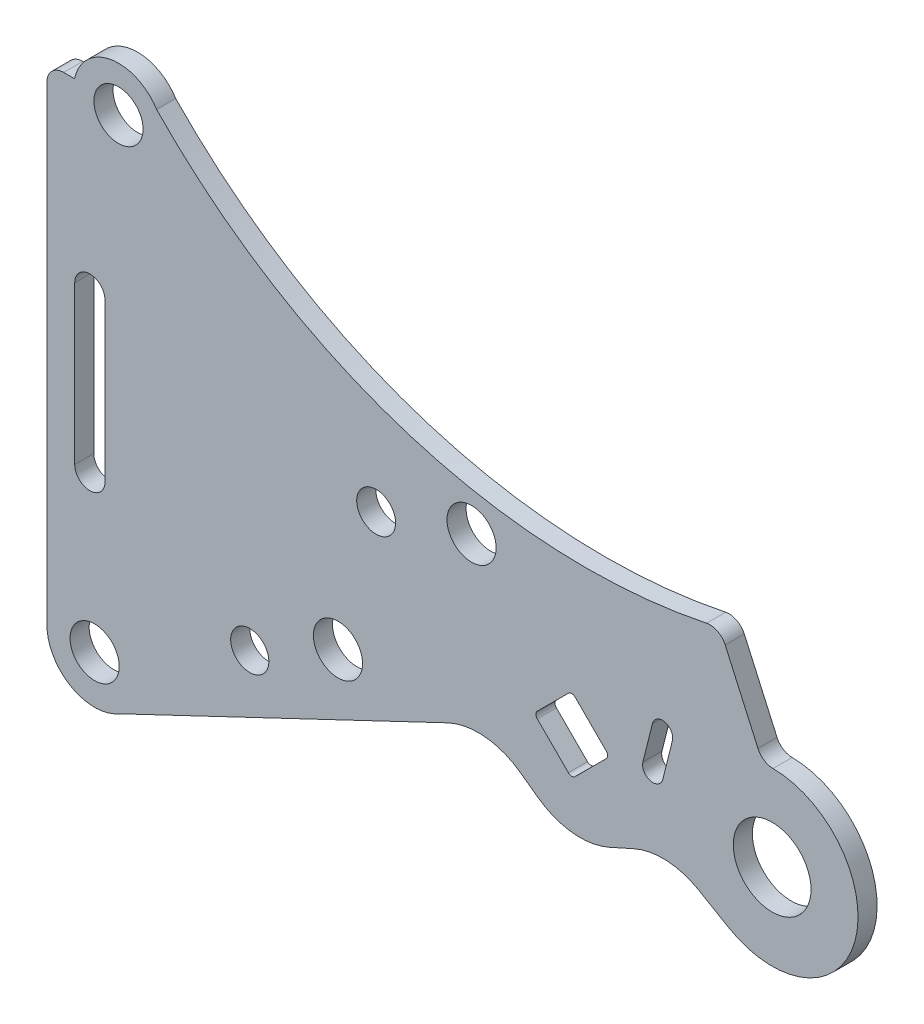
ISO-10303-21;
HEADER;
FILE_DESCRIPTION(('STEP AP214'),'2;1');
FILE_NAME('part.step','',(''),(''),'','','');
FILE_SCHEMA(('AUTOMOTIVE_DESIGN { 1 0 10303 214 1 1 1 1 }'));
ENDSEC;
DATA;
#1=APPLICATION_CONTEXT('core data for automotive mechanical design processes');
#2=APPLICATION_PROTOCOL_DEFINITION('international standard','automotive_design',2000,#1);
#3=PRODUCT_CONTEXT('',#1,'mechanical');
#4=PRODUCT('Part','Part','',(#3));
#5=PRODUCT_RELATED_PRODUCT_CATEGORY('part','',(#4));
#6=PRODUCT_DEFINITION_FORMATION('','',#4);
#7=PRODUCT_DEFINITION_CONTEXT('part definition',#1,'design');
#8=PRODUCT_DEFINITION('design','',#6,#7);
#9=PRODUCT_DEFINITION_SHAPE('','',#8);
#10=(LENGTH_UNIT() NAMED_UNIT(*) SI_UNIT(.MILLI.,.METRE.));
#11=(NAMED_UNIT(*) PLANE_ANGLE_UNIT() SI_UNIT($,.RADIAN.));
#12=(NAMED_UNIT(*) SI_UNIT($,.STERADIAN.) SOLID_ANGLE_UNIT());
#13=UNCERTAINTY_MEASURE_WITH_UNIT(LENGTH_MEASURE(1.E-05),#10,'distance_accuracy_value','');
#14=(GEOMETRIC_REPRESENTATION_CONTEXT(3) GLOBAL_UNCERTAINTY_ASSIGNED_CONTEXT((#13)) GLOBAL_UNIT_ASSIGNED_CONTEXT((#10,
#11,#12)) REPRESENTATION_CONTEXT('',''));
#15=CARTESIAN_POINT('',(0.,0.,0.));
#16=DIRECTION('',(0.,0.,1.));
#17=DIRECTION('',(1.,0.,0.));
#18=AXIS2_PLACEMENT_3D('',#15,#16,#17);
#19=CARTESIAN_POINT('',(-11.5,-1.5,4.));
#20=DIRECTION('',(0.,0.,1.));
#21=DIRECTION('',(1.,0.,0.));
#22=AXIS2_PLACEMENT_3D('',#19,#20,#21);
#23=PLANE('',#22);
#24=CARTESIAN_POINT('',(74.,-39.,4.));
#25=DIRECTION('',(0.,0.,1.));
#26=DIRECTION('',(1.,0.,0.));
#27=AXIS2_PLACEMENT_3D('',#24,#25,#26);
#28=CIRCLE('',#27,5.15);
#29=CARTESIAN_POINT('',(79.15,-39.,4.));
#30=VERTEX_POINT('',#29);
#31=EDGE_CURVE('E391',#30,#30,#28,.T.);
#32=ORIENTED_EDGE('',*,*,#31,.F.);
#33=EDGE_LOOP('',(#32));
#34=FACE_BOUND('',#33,.T.);
#35=CARTESIAN_POINT('',(27.5180743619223,-83.4221581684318,4.));
#36=DIRECTION('',(0.,0.,1.));
#37=DIRECTION('',(1.,0.,0.));
#38=AXIS2_PLACEMENT_3D('',#35,#36,#37);
#39=CIRCLE('',#38,4.);
#40=CARTESIAN_POINT('',(31.5180743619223,-83.4221581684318,4.));
#41=VERTEX_POINT('',#40);
#42=EDGE_CURVE('E403',#41,#41,#39,.T.);
#43=ORIENTED_EDGE('',*,*,#42,.F.);
#44=EDGE_LOOP('',(#43));
#45=FACE_BOUND('',#44,.T.);
#46=CARTESIAN_POINT('',(-4.99999999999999,-100.,4.));
#47=DIRECTION('',(0.,0.,1.));
#48=DIRECTION('',(1.,0.,0.));
#49=AXIS2_PLACEMENT_3D('',#46,#47,#48);
#50=CIRCLE('',#49,5.15);
#51=CARTESIAN_POINT('',(0.150000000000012,-100.,4.));
#52=VERTEX_POINT('',#51);
#53=EDGE_CURVE('E415',#52,#52,#50,.T.);
#54=ORIENTED_EDGE('',*,*,#53,.F.);
#55=EDGE_LOOP('',(#54));
#56=FACE_BOUND('',#55,.T.);
#57=CARTESIAN_POINT('',(-11.5,-1.5,4.));
#58=DIRECTION('',(0.,0.,1.));
#59=DIRECTION('',(1.,0.,0.));
#60=AXIS2_PLACEMENT_3D('',#57,#58,#59);
#61=CIRCLE('',#60,3.5);
#62=CARTESIAN_POINT('',(-11.5,2.,4.));
#63=VERTEX_POINT('',#62);
#64=CARTESIAN_POINT('',(-15.,-1.50000000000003,4.));
#65=VERTEX_POINT('',#64);
#66=EDGE_CURVE('E427',#63,#65,#61,.T.);
#67=ORIENTED_EDGE('',*,*,#66,.T.);
#68=DIRECTION('',(0.,-1.,0.));
#69=VECTOR('',#68,1.);
#70=CARTESIAN_POINT('',(-15.,-1.50000000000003,4.));
#71=LINE('',#70,#69);
#72=CARTESIAN_POINT('',(-15.,-100.,4.));
#73=VERTEX_POINT('',#72);
#74=EDGE_CURVE('E430',#65,#73,#71,.T.);
#75=ORIENTED_EDGE('',*,*,#74,.T.);
#76=CARTESIAN_POINT('',(-4.99999999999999,-100.,4.));
#77=DIRECTION('',(0.,0.,1.));
#78=DIRECTION('',(1.,0.,0.));
#79=AXIS2_PLACEMENT_3D('',#76,#77,#78);
#80=CIRCLE('',#79,9.99999999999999);
#81=CARTESIAN_POINT('',(0.,-108.660254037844,4.));
#82=VERTEX_POINT('',#81);
#83=EDGE_CURVE('E433',#73,#82,#80,.T.);
#84=ORIENTED_EDGE('',*,*,#83,.T.);
#85=DIRECTION('',(0.902889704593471,0.429872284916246,0.));
#86=VECTOR('',#85,1.);
#87=CARTESIAN_POINT('',(0.,-108.660254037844,4.));
#88=LINE('',#87,#86);
#89=CARTESIAN_POINT('',(68.9749888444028,-75.8207655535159,4.));
#90=VERTEX_POINT('',#89);
#91=EDGE_CURVE('E435',#82,#90,#88,.T.);
#92=ORIENTED_EDGE('',*,*,#91,.T.);
#93=CARTESIAN_POINT('',(75.4230731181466,-89.364111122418,4.));
#94=DIRECTION('',(0.,0.,-1.));
#95=DIRECTION('',(-1.,0.,0.));
#96=AXIS2_PLACEMENT_3D('',#93,#94,#95);
#97=CIRCLE('',#96,15.);
#98=CARTESIAN_POINT('',(84.205431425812,-77.2039226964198,4.));
#99=VERTEX_POINT('',#98);
#100=EDGE_CURVE('E437',#90,#99,#97,.T.);
#101=ORIENTED_EDGE('',*,*,#100,.T.);
#102=DIRECTION('',(0.810679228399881,-0.585490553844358,0.));
#103=VECTOR('',#102,1.);
#104=CARTESIAN_POINT('',(84.205431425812,-77.2039226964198,4.));
#105=LINE('',#104,#103);
#106=CARTESIAN_POINT('',(87.9700556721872,-79.9228179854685,4.));
#107=VERTEX_POINT('',#106);
#108=EDGE_CURVE('E439',#99,#107,#105,.T.);
#109=ORIENTED_EDGE('',*,*,#108,.T.);
#110=CARTESIAN_POINT('',(96.7524139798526,-67.7626295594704,4.));
#111=DIRECTION('',(0.,0.,1.));
#112=DIRECTION('',(1.,0.,0.));
#113=AXIS2_PLACEMENT_3D('',#110,#111,#112);
#114=CIRCLE('',#113,15.);
#115=CARTESIAN_POINT('',(102.907884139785,-81.4414521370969,4.));
#116=VERTEX_POINT('',#115);
#117=EDGE_CURVE('E441',#107,#116,#114,.T.);
#118=ORIENTED_EDGE('',*,*,#117,.T.);
#119=DIRECTION('',(0.911921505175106,0.410364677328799,0.));
#120=VECTOR('',#119,1.);
#121=CARTESIAN_POINT('',(102.907884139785,-81.4414521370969,4.));
#122=LINE('',#121,#120);
#123=CARTESIAN_POINT('',(107.95466961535,-79.1703986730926,4.));
#124=VERTEX_POINT('',#123);
#125=EDGE_CURVE('E443',#116,#124,#122,.T.);
#126=ORIENTED_EDGE('',*,*,#125,.T.);
#127=CARTESIAN_POINT('',(114.110139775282,-92.8492212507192,4.));
#128=DIRECTION('',(0.,0.,-1.));
#129=DIRECTION('',(-1.,0.,0.));
#130=AXIS2_PLACEMENT_3D('',#127,#128,#129);
#131=CIRCLE('',#130,15.);
#132=CARTESIAN_POINT('',(121.672191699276,-79.8948640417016,4.));
#133=VERTEX_POINT('',#132);
#134=EDGE_CURVE('E445',#124,#133,#131,.T.);
#135=ORIENTED_EDGE('',*,*,#134,.T.);
#136=DIRECTION('',(0.863623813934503,-0.504136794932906,0.));
#137=VECTOR('',#136,1.);
#138=CARTESIAN_POINT('',(121.672191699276,-79.8948640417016,4.));
#139=LINE('',#138,#137);
#140=CARTESIAN_POINT('',(127.925537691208,-83.545228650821,4.));
#141=VERTEX_POINT('',#140);
#142=EDGE_CURVE('E447',#133,#141,#139,.T.);
#143=ORIENTED_EDGE('',*,*,#142,.T.);
#144=CARTESIAN_POINT('',(137.,-68.,4.));
#145=DIRECTION('',(0.,0.,1.));
#146=DIRECTION('',(1.,0.,0.));
#147=AXIS2_PLACEMENT_3D('',#144,#145,#146);
#148=CIRCLE('',#147,18.);
#149=CARTESIAN_POINT('',(137.183202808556,-50.0009323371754,4.));
#150=VERTEX_POINT('',#149);
#151=EDGE_CURVE('E449',#141,#150,#148,.T.);
#152=ORIENTED_EDGE('',*,*,#151,.T.);
#153=CARTESIAN_POINT('',(137.218825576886,-46.5011136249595,4.));
#154=DIRECTION('',(0.,0.,-1.));
#155=DIRECTION('',(1.,0.,0.));
#156=AXIS2_PLACEMENT_3D('',#153,#154,#155);
#157=CIRCLE('',#156,3.5);
#158=CARTESIAN_POINT('',(134.024125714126,-47.930761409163,4.));
#159=VERTEX_POINT('',#158);
#160=EDGE_CURVE('E451',#150,#159,#157,.T.);
#161=ORIENTED_EDGE('',*,*,#160,.T.);
#162=DIRECTION('',(-0.408470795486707,0.912771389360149,0.));
#163=VECTOR('',#162,1.);
#164=CARTESIAN_POINT('',(134.024125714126,-47.930761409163,4.));
#165=LINE('',#164,#163);
#166=CARTESIAN_POINT('',(127.162179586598,-32.5970137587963,4.));
#167=VERTEX_POINT('',#166);
#168=EDGE_CURVE('E453',#159,#167,#165,.T.);
#169=ORIENTED_EDGE('',*,*,#168,.T.);
#170=CARTESIAN_POINT('',(123.967479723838,-34.0266615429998,4.));
#171=DIRECTION('',(0.,0.,1.));
#172=DIRECTION('',(1.,0.,0.));
#173=AXIS2_PLACEMENT_3D('',#170,#171,#172);
#174=CIRCLE('',#173,3.49999999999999);
#175=CARTESIAN_POINT('',(123.258541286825,-30.5992125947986,4.));
#176=VERTEX_POINT('',#175);
#177=EDGE_CURVE('E455',#167,#176,#174,.T.);
#178=ORIENTED_EDGE('',*,*,#177,.T.);
#179=CARTESIAN_POINT('',(97.9393113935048,91.8096784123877,4.));
#180=DIRECTION('',(0.,0.,-1.));
#181=DIRECTION('',(1.,0.,0.));
#182=AXIS2_PLACEMENT_3D('',#179,#180,#181);
#183=CIRCLE('',#182,125.);
#184=CARTESIAN_POINT('',(8.,5.,4.));
#185=VERTEX_POINT('',#184);
#186=EDGE_CURVE('E457',#176,#185,#183,.T.);
#187=ORIENTED_EDGE('',*,*,#186,.T.);
#188=CARTESIAN_POINT('',(0.,0.,4.));
#189=DIRECTION('',(0.,0.,1.));
#190=DIRECTION('',(1.,0.,0.));
#191=AXIS2_PLACEMENT_3D('',#188,#189,#190);
#192=CIRCLE('',#191,9.4339811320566);
#193=CARTESIAN_POINT('',(-9.21954445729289,2.,4.));
#194=VERTEX_POINT('',#193);
#195=EDGE_CURVE('E459',#185,#194,#192,.T.);
#196=ORIENTED_EDGE('',*,*,#195,.T.);
#197=DIRECTION('',(-1.,0.,0.));
#198=VECTOR('',#197,1.);
#199=CARTESIAN_POINT('',(-9.21954445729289,2.,4.));
#200=LINE('',#199,#198);
#201=EDGE_CURVE('E461',#194,#63,#200,.T.);
#202=ORIENTED_EDGE('',*,*,#201,.T.);
#203=EDGE_LOOP('',(#67,#75,#84,#92,#101,#109,#118,#126,#135,#143,#152,#161,#169,#178,#187,#196,#202));
#204=FACE_BOUND('',#203,.T.);
#205=CARTESIAN_POINT('',(0.,0.,4.));
#206=DIRECTION('',(0.,0.,1.));
#207=DIRECTION('',(1.,0.,0.));
#208=AXIS2_PLACEMENT_3D('',#205,#206,#207);
#209=CIRCLE('',#208,5.15);
#210=CARTESIAN_POINT('',(5.15,0.,4.));
#211=VERTEX_POINT('',#210);
#212=EDGE_CURVE('E421',#211,#211,#209,.T.);
#213=ORIENTED_EDGE('',*,*,#212,.F.);
#214=EDGE_LOOP('',(#213));
#215=FACE_BOUND('',#214,.T.);
#216=CARTESIAN_POINT('',(46.,-74.,4.));
#217=DIRECTION('',(0.,0.,1.));
#218=DIRECTION('',(1.,0.,0.));
#219=AXIS2_PLACEMENT_3D('',#216,#217,#218);
#220=CIRCLE('',#219,5.15);
#221=CARTESIAN_POINT('',(51.15,-74.,4.));
#222=VERTEX_POINT('',#221);
#223=EDGE_CURVE('E409',#222,#222,#220,.T.);
#224=ORIENTED_EDGE('',*,*,#223,.F.);
#225=EDGE_LOOP('',(#224));
#226=FACE_BOUND('',#225,.T.);
#227=CARTESIAN_POINT('',(54.,-45.,4.));
#228=DIRECTION('',(0.,0.,1.));
#229=DIRECTION('',(1.,0.,0.));
#230=AXIS2_PLACEMENT_3D('',#227,#228,#229);
#231=CIRCLE('',#230,4.075);
#232=CARTESIAN_POINT('',(58.075,-45.,4.));
#233=VERTEX_POINT('',#232);
#234=EDGE_CURVE('E397',#233,#233,#231,.T.);
#235=ORIENTED_EDGE('',*,*,#234,.F.);
#236=EDGE_LOOP('',(#235));
#237=FACE_BOUND('',#236,.T.);
#238=CARTESIAN_POINT('',(137.,-68.,4.));
#239=DIRECTION('',(0.,0.,1.));
#240=DIRECTION('',(1.,0.,0.));
#241=AXIS2_PLACEMENT_3D('',#238,#239,#240);
#242=CIRCLE('',#241,8.15);
#243=CARTESIAN_POINT('',(145.15,-68.,4.));
#244=VERTEX_POINT('',#243);
#245=EDGE_CURVE('E385',#244,#244,#242,.T.);
#246=ORIENTED_EDGE('',*,*,#245,.F.);
#247=EDGE_LOOP('',(#246));
#248=FACE_BOUND('',#247,.T.);
#249=DIRECTION('',(0.,1.,0.));
#250=VECTOR('',#249,1.);
#251=CARTESIAN_POINT('',(-2.825,-35.,4.));
#252=LINE('',#251,#250);
#253=CARTESIAN_POINT('',(-2.82499999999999,-68.,4.));
#254=VERTEX_POINT('',#253);
#255=CARTESIAN_POINT('',(-2.825,-35.,4.));
#256=VERTEX_POINT('',#255);
#257=EDGE_CURVE('E356',#254,#256,#252,.T.);
#258=ORIENTED_EDGE('',*,*,#257,.F.);
#259=CARTESIAN_POINT('',(-5.99999999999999,-68.,4.));
#260=DIRECTION('',(0.,0.,1.));
#261=DIRECTION('',(1.,0.,0.));
#262=AXIS2_PLACEMENT_3D('',#259,#260,#261);
#263=CIRCLE('',#262,3.175);
#264=CARTESIAN_POINT('',(-9.17499999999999,-68.,4.));
#265=VERTEX_POINT('',#264);
#266=EDGE_CURVE('E354',#265,#254,#263,.T.);
#267=ORIENTED_EDGE('',*,*,#266,.F.);
#268=DIRECTION('',(0.,-1.,0.));
#269=VECTOR('',#268,1.);
#270=CARTESIAN_POINT('',(-9.17499999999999,-68.,4.));
#271=LINE('',#270,#269);
#272=CARTESIAN_POINT('',(-9.175,-35.,4.));
#273=VERTEX_POINT('',#272);
#274=EDGE_CURVE('E362',#273,#265,#271,.T.);
#275=ORIENTED_EDGE('',*,*,#274,.F.);
#276=CARTESIAN_POINT('',(-6.,-35.,4.));
#277=DIRECTION('',(0.,0.,1.));
#278=DIRECTION('',(1.,0.,0.));
#279=AXIS2_PLACEMENT_3D('',#276,#277,#278);
#280=CIRCLE('',#279,3.175);
#281=EDGE_CURVE('E359',#256,#273,#280,.T.);
#282=ORIENTED_EDGE('',*,*,#281,.F.);
#283=EDGE_LOOP('',(#258,#267,#275,#282));
#284=FACE_BOUND('',#283,.T.);
#285=DIRECTION('',(-0.242535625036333,-0.970142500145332,0.));
#286=VECTOR('',#285,1.);
#287=CARTESIAN_POINT('',(111.914193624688,-54.4785484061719,4.));
#288=LINE('',#287,#286);
#289=CARTESIAN_POINT('',(111.914193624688,-54.4785484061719,4.));
#290=VERTEX_POINT('',#289);
#291=CARTESIAN_POINT('',(109.914193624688,-62.4785484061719,4.));
#292=VERTEX_POINT('',#291);
#293=EDGE_CURVE('E325',#290,#292,#288,.T.);
#294=ORIENTED_EDGE('',*,*,#293,.F.);
#295=CARTESIAN_POINT('',(114.,-55.,4.));
#296=DIRECTION('',(0.,0.,1.));
#297=DIRECTION('',(1.,0.,0.));
#298=AXIS2_PLACEMENT_3D('',#295,#296,#297);
#299=CIRCLE('',#298,2.15);
#300=CARTESIAN_POINT('',(116.085806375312,-55.5214515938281,4.));
#301=VERTEX_POINT('',#300);
#302=EDGE_CURVE('E323',#301,#290,#299,.T.);
#303=ORIENTED_EDGE('',*,*,#302,.F.);
#304=DIRECTION('',(0.24253562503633,0.970142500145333,0.));
#305=VECTOR('',#304,1.);
#306=CARTESIAN_POINT('',(116.085806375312,-55.5214515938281,4.));
#307=LINE('',#306,#305);
#308=CARTESIAN_POINT('',(114.085806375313,-63.5214515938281,4.));
#309=VERTEX_POINT('',#308);
#310=EDGE_CURVE('E331',#309,#301,#307,.T.);
#311=ORIENTED_EDGE('',*,*,#310,.F.);
#312=CARTESIAN_POINT('',(112.,-63.,4.));
#313=DIRECTION('',(0.,0.,1.));
#314=DIRECTION('',(1.,0.,0.));
#315=AXIS2_PLACEMENT_3D('',#312,#313,#314);
#316=CIRCLE('',#315,2.15000000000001);
#317=EDGE_CURVE('E328',#292,#309,#316,.T.);
#318=ORIENTED_EDGE('',*,*,#317,.F.);
#319=EDGE_LOOP('',(#294,#303,#311,#318));
#320=FACE_BOUND('',#319,.T.);
#321=DIRECTION('',(0.70710678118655,-0.707106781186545,0.));
#322=VECTOR('',#321,1.);
#323=CARTESIAN_POINT('',(87.7875108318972,-65.7071067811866,4.));
#324=LINE('',#323,#322);
#325=CARTESIAN_POINT('',(87.7875108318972,-65.7071067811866,4.));
#326=VERTEX_POINT('',#325);
#327=CARTESIAN_POINT('',(94.2928932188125,-72.2124891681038,4.));
#328=VERTEX_POINT('',#327);
#329=EDGE_CURVE('E266',#326,#328,#324,.T.);
#330=ORIENTED_EDGE('',*,*,#329,.F.);
#331=CARTESIAN_POINT('',(88.4946176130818,-64.9999999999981,4.));
#332=DIRECTION('',(0.,0.,1.));
#333=DIRECTION('',(1.,0.,0.));
#334=AXIS2_PLACEMENT_3D('',#331,#332,#333);
#335=CIRCLE('',#334,0.999999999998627);
#336=CARTESIAN_POINT('',(87.7875108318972,-64.2928932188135,4.));
#337=VERTEX_POINT('',#336);
#338=EDGE_CURVE('E258',#337,#326,#335,.T.);
#339=ORIENTED_EDGE('',*,*,#338,.F.);
#340=DIRECTION('',(-0.707106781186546,-0.707106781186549,0.));
#341=VECTOR('',#340,1.);
#342=CARTESIAN_POINT('',(87.7875108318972,-64.2928932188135,4.));
#343=LINE('',#342,#341);
#344=CARTESIAN_POINT('',(94.2928932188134,-57.7875108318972,4.));
#345=VERTEX_POINT('',#344);
#346=EDGE_CURVE('E291',#345,#337,#343,.T.);
#347=ORIENTED_EDGE('',*,*,#346,.F.);
#348=CARTESIAN_POINT('',(94.999999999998,-58.4946176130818,4.));
#349=DIRECTION('',(0.,0.,1.));
#350=DIRECTION('',(-1.,0.,0.));
#351=AXIS2_PLACEMENT_3D('',#348,#349,#350);
#352=CIRCLE('',#351,0.99999999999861);
#353=CARTESIAN_POINT('',(95.7071067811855,-57.7875108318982,4.));
#354=VERTEX_POINT('',#353);
#355=EDGE_CURVE('E289',#354,#345,#352,.T.);
#356=ORIENTED_EDGE('',*,*,#355,.F.);
#357=DIRECTION('',(-0.707106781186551,0.707106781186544,0.));
#358=VECTOR('',#357,1.);
#359=CARTESIAN_POINT('',(95.7071067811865,-57.7875108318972,4.));
#360=LINE('',#359,#358);
#361=CARTESIAN_POINT('',(102.212489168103,-64.2928932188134,4.));
#362=VERTEX_POINT('',#361);
#363=EDGE_CURVE('E287',#362,#354,#360,.T.);
#364=ORIENTED_EDGE('',*,*,#363,.F.);
#365=CARTESIAN_POINT('',(101.505382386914,-64.999999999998,4.));
#366=DIRECTION('',(0.,0.,1.));
#367=DIRECTION('',(1.,0.,0.));
#368=AXIS2_PLACEMENT_3D('',#365,#366,#367);
#369=CIRCLE('',#368,1.00000000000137);
#370=CARTESIAN_POINT('',(102.212489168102,-65.7071067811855,4.));
#371=VERTEX_POINT('',#370);
#372=EDGE_CURVE('E285',#371,#362,#369,.T.);
#373=ORIENTED_EDGE('',*,*,#372,.F.);
#374=DIRECTION('',(0.707106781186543,0.707106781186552,0.));
#375=VECTOR('',#374,1.);
#376=CARTESIAN_POINT('',(95.7071067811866,-72.2124891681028,4.));
#377=LINE('',#376,#375);
#378=CARTESIAN_POINT('',(95.7071067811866,-72.2124891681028,4.));
#379=VERTEX_POINT('',#378);
#380=EDGE_CURVE('E281',#379,#371,#377,.T.);
#381=ORIENTED_EDGE('',*,*,#380,.F.);
#382=CARTESIAN_POINT('',(94.9999999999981,-71.5053823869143,4.));
#383=DIRECTION('',(0.,0.,1.));
#384=DIRECTION('',(1.,0.,0.));
#385=AXIS2_PLACEMENT_3D('',#382,#383,#384);
#386=CIRCLE('',#385,1.00000000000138);
#387=EDGE_CURVE('E279',#328,#379,#386,.T.);
#388=ORIENTED_EDGE('',*,*,#387,.F.);
#389=EDGE_LOOP('',(#330,#339,#347,#356,#364,#373,#381,#388));
#390=FACE_BOUND('',#389,.T.);
#391=ADVANCED_FACE('F43',(#34,#45,#56,#204,#215,#226,#237,#248,#284,#320,#390),#23,.T.);
#392=CARTESIAN_POINT('',(-11.5,-1.5,0.));
#393=DIRECTION('',(0.,0.,1.));
#394=DIRECTION('',(1.,0.,0.));
#395=AXIS2_PLACEMENT_3D('',#392,#393,#394);
#396=PLANE('',#395);
#397=CARTESIAN_POINT('',(114.,-55.,0.));
#398=DIRECTION('',(0.,0.,1.));
#399=DIRECTION('',(1.,0.,0.));
#400=AXIS2_PLACEMENT_3D('',#397,#398,#399);
#401=CIRCLE('',#400,2.15);
#402=CARTESIAN_POINT('',(116.085806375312,-55.5214515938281,0.));
#403=VERTEX_POINT('',#402);
#404=CARTESIAN_POINT('',(111.914193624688,-54.4785484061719,0.));
#405=VERTEX_POINT('',#404);
#406=EDGE_CURVE('E274',#403,#405,#401,.T.);
#407=ORIENTED_EDGE('',*,*,#406,.T.);
#408=DIRECTION('',(-0.242535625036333,-0.970142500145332,0.));
#409=VECTOR('',#408,1.);
#410=CARTESIAN_POINT('',(111.914193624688,-54.4785484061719,0.));
#411=LINE('',#410,#409);
#412=CARTESIAN_POINT('',(109.914193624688,-62.4785484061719,0.));
#413=VERTEX_POINT('',#412);
#414=EDGE_CURVE('E336',#405,#413,#411,.T.);
#415=ORIENTED_EDGE('',*,*,#414,.T.);
#416=CARTESIAN_POINT('',(112.,-63.,0.));
#417=DIRECTION('',(0.,0.,1.));
#418=DIRECTION('',(1.,0.,0.));
#419=AXIS2_PLACEMENT_3D('',#416,#417,#418);
#420=CIRCLE('',#419,2.15000000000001);
#421=CARTESIAN_POINT('',(114.085806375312,-63.5214515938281,0.));
#422=VERTEX_POINT('',#421);
#423=EDGE_CURVE('E339',#413,#422,#420,.T.);
#424=ORIENTED_EDGE('',*,*,#423,.T.);
#425=DIRECTION('',(0.24253562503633,0.970142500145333,0.));
#426=VECTOR('',#425,1.);
#427=CARTESIAN_POINT('',(116.085806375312,-55.5214515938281,0.));
#428=LINE('',#427,#426);
#429=EDGE_CURVE('E326',#422,#403,#428,.T.);
#430=ORIENTED_EDGE('',*,*,#429,.T.);
#431=EDGE_LOOP('',(#407,#415,#424,#430));
#432=FACE_BOUND('',#431,.T.);
#433=CARTESIAN_POINT('',(137.,-68.,0.));
#434=DIRECTION('',(0.,0.,1.));
#435=DIRECTION('',(1.,0.,0.));
#436=AXIS2_PLACEMENT_3D('',#433,#434,#435);
#437=CIRCLE('',#436,8.15);
#438=CARTESIAN_POINT('',(145.15,-68.,0.));
#439=VERTEX_POINT('',#438);
#440=EDGE_CURVE('E384',#439,#439,#437,.T.);
#441=ORIENTED_EDGE('',*,*,#440,.T.);
#442=EDGE_LOOP('',(#441));
#443=FACE_BOUND('',#442,.T.);
#444=CARTESIAN_POINT('',(74.,-39.,0.));
#445=DIRECTION('',(0.,0.,1.));
#446=DIRECTION('',(1.,0.,0.));
#447=AXIS2_PLACEMENT_3D('',#444,#445,#446);
#448=CIRCLE('',#447,5.15);
#449=CARTESIAN_POINT('',(79.15,-39.,0.));
#450=VERTEX_POINT('',#449);
#451=EDGE_CURVE('E388',#450,#450,#448,.T.);
#452=ORIENTED_EDGE('',*,*,#451,.T.);
#453=EDGE_LOOP('',(#452));
#454=FACE_BOUND('',#453,.T.);
#455=CARTESIAN_POINT('',(54.,-45.,0.));
#456=DIRECTION('',(0.,0.,1.));
#457=DIRECTION('',(1.,0.,0.));
#458=AXIS2_PLACEMENT_3D('',#455,#456,#457);
#459=CIRCLE('',#458,4.075);
#460=CARTESIAN_POINT('',(58.075,-45.,0.));
#461=VERTEX_POINT('',#460);
#462=EDGE_CURVE('E394',#461,#461,#459,.T.);
#463=ORIENTED_EDGE('',*,*,#462,.T.);
#464=EDGE_LOOP('',(#463));
#465=FACE_BOUND('',#464,.T.);
#466=CARTESIAN_POINT('',(27.5180743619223,-83.4221581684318,0.));
#467=DIRECTION('',(0.,0.,1.));
#468=DIRECTION('',(1.,0.,0.));
#469=AXIS2_PLACEMENT_3D('',#466,#467,#468);
#470=CIRCLE('',#469,4.);
#471=CARTESIAN_POINT('',(31.5180743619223,-83.4221581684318,0.));
#472=VERTEX_POINT('',#471);
#473=EDGE_CURVE('E400',#472,#472,#470,.T.);
#474=ORIENTED_EDGE('',*,*,#473,.T.);
#475=EDGE_LOOP('',(#474));
#476=FACE_BOUND('',#475,.T.);
#477=CARTESIAN_POINT('',(46.,-74.,0.));
#478=DIRECTION('',(0.,0.,1.));
#479=DIRECTION('',(1.,0.,0.));
#480=AXIS2_PLACEMENT_3D('',#477,#478,#479);
#481=CIRCLE('',#480,5.15);
#482=CARTESIAN_POINT('',(51.15,-74.,0.));
#483=VERTEX_POINT('',#482);
#484=EDGE_CURVE('E406',#483,#483,#481,.T.);
#485=ORIENTED_EDGE('',*,*,#484,.T.);
#486=EDGE_LOOP('',(#485));
#487=FACE_BOUND('',#486,.T.);
#488=CARTESIAN_POINT('',(-4.99999999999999,-100.,0.));
#489=DIRECTION('',(0.,0.,1.));
#490=DIRECTION('',(1.,0.,0.));
#491=AXIS2_PLACEMENT_3D('',#488,#489,#490);
#492=CIRCLE('',#491,5.15);
#493=CARTESIAN_POINT('',(0.150000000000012,-100.,0.));
#494=VERTEX_POINT('',#493);
#495=EDGE_CURVE('E412',#494,#494,#492,.T.);
#496=ORIENTED_EDGE('',*,*,#495,.T.);
#497=EDGE_LOOP('',(#496));
#498=FACE_BOUND('',#497,.T.);
#499=CARTESIAN_POINT('',(0.,0.,0.));
#500=DIRECTION('',(0.,0.,1.));
#501=DIRECTION('',(1.,0.,0.));
#502=AXIS2_PLACEMENT_3D('',#499,#500,#501);
#503=CIRCLE('',#502,5.15);
#504=CARTESIAN_POINT('',(5.15,0.,0.));
#505=VERTEX_POINT('',#504);
#506=EDGE_CURVE('E418',#505,#505,#503,.T.);
#507=ORIENTED_EDGE('',*,*,#506,.T.);
#508=EDGE_LOOP('',(#507));
#509=FACE_BOUND('',#508,.T.);
#510=CARTESIAN_POINT('',(-11.5,-1.5,0.));
#511=DIRECTION('',(0.,0.,1.));
#512=DIRECTION('',(1.,0.,0.));
#513=AXIS2_PLACEMENT_3D('',#510,#511,#512);
#514=CIRCLE('',#513,3.5);
#515=CARTESIAN_POINT('',(-11.5,2.,0.));
#516=VERTEX_POINT('',#515);
#517=CARTESIAN_POINT('',(-15.,-1.50000000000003,0.));
#518=VERTEX_POINT('',#517);
#519=EDGE_CURVE('E424',#516,#518,#514,.T.);
#520=ORIENTED_EDGE('',*,*,#519,.F.);
#521=DIRECTION('',(-1.,0.,0.));
#522=VECTOR('',#521,1.);
#523=CARTESIAN_POINT('',(-9.21954445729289,2.,0.));
#524=LINE('',#523,#522);
#525=CARTESIAN_POINT('',(-9.21954445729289,2.,0.));
#526=VERTEX_POINT('',#525);
#527=EDGE_CURVE('E431',#526,#516,#524,.T.);
#528=ORIENTED_EDGE('',*,*,#527,.F.);
#529=CARTESIAN_POINT('',(0.,0.,0.));
#530=DIRECTION('',(0.,0.,1.));
#531=DIRECTION('',(1.,0.,0.));
#532=AXIS2_PLACEMENT_3D('',#529,#530,#531);
#533=CIRCLE('',#532,9.4339811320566);
#534=CARTESIAN_POINT('',(8.,5.,0.));
#535=VERTEX_POINT('',#534);
#536=EDGE_CURVE('E494',#535,#526,#533,.T.);
#537=ORIENTED_EDGE('',*,*,#536,.F.);
#538=CARTESIAN_POINT('',(97.9393113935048,91.8096784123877,0.));
#539=DIRECTION('',(0.,0.,-1.));
#540=DIRECTION('',(1.,0.,0.));
#541=AXIS2_PLACEMENT_3D('',#538,#539,#540);
#542=CIRCLE('',#541,125.);
#543=CARTESIAN_POINT('',(123.258541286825,-30.5992125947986,0.));
#544=VERTEX_POINT('',#543);
#545=EDGE_CURVE('E492',#544,#535,#542,.T.);
#546=ORIENTED_EDGE('',*,*,#545,.F.);
#547=CARTESIAN_POINT('',(123.967479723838,-34.0266615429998,0.));
#548=DIRECTION('',(0.,0.,1.));
#549=DIRECTION('',(1.,0.,0.));
#550=AXIS2_PLACEMENT_3D('',#547,#548,#549);
#551=CIRCLE('',#550,3.49999999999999);
#552=CARTESIAN_POINT('',(127.162179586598,-32.5970137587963,0.));
#553=VERTEX_POINT('',#552);
#554=EDGE_CURVE('E490',#553,#544,#551,.T.);
#555=ORIENTED_EDGE('',*,*,#554,.F.);
#556=DIRECTION('',(-0.408470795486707,0.912771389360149,0.));
#557=VECTOR('',#556,1.);
#558=CARTESIAN_POINT('',(134.024125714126,-47.930761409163,0.));
#559=LINE('',#558,#557);
#560=CARTESIAN_POINT('',(134.024125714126,-47.930761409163,0.));
#561=VERTEX_POINT('',#560);
#562=EDGE_CURVE('E488',#561,#553,#559,.T.);
#563=ORIENTED_EDGE('',*,*,#562,.F.);
#564=CARTESIAN_POINT('',(137.218825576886,-46.5011136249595,0.));
#565=DIRECTION('',(0.,0.,-1.));
#566=DIRECTION('',(1.,0.,0.));
#567=AXIS2_PLACEMENT_3D('',#564,#565,#566);
#568=CIRCLE('',#567,3.5);
#569=CARTESIAN_POINT('',(137.183202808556,-50.0009323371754,0.));
#570=VERTEX_POINT('',#569);
#571=EDGE_CURVE('E486',#570,#561,#568,.T.);
#572=ORIENTED_EDGE('',*,*,#571,.F.);
#573=CARTESIAN_POINT('',(137.,-68.,0.));
#574=DIRECTION('',(0.,0.,1.));
#575=DIRECTION('',(1.,0.,0.));
#576=AXIS2_PLACEMENT_3D('',#573,#574,#575);
#577=CIRCLE('',#576,18.);
#578=CARTESIAN_POINT('',(127.925537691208,-83.545228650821,0.));
#579=VERTEX_POINT('',#578);
#580=EDGE_CURVE('E484',#579,#570,#577,.T.);
#581=ORIENTED_EDGE('',*,*,#580,.F.);
#582=DIRECTION('',(0.863623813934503,-0.504136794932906,0.));
#583=VECTOR('',#582,1.);
#584=CARTESIAN_POINT('',(121.672191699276,-79.8948640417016,0.));
#585=LINE('',#584,#583);
#586=CARTESIAN_POINT('',(121.672191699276,-79.8948640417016,0.));
#587=VERTEX_POINT('',#586);
#588=EDGE_CURVE('E482',#587,#579,#585,.T.);
#589=ORIENTED_EDGE('',*,*,#588,.F.);
#590=CARTESIAN_POINT('',(114.110139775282,-92.8492212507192,0.));
#591=DIRECTION('',(0.,0.,-1.));
#592=DIRECTION('',(-1.,0.,0.));
#593=AXIS2_PLACEMENT_3D('',#590,#591,#592);
#594=CIRCLE('',#593,15.);
#595=CARTESIAN_POINT('',(107.95466961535,-79.1703986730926,0.));
#596=VERTEX_POINT('',#595);
#597=EDGE_CURVE('E480',#596,#587,#594,.T.);
#598=ORIENTED_EDGE('',*,*,#597,.F.);
#599=DIRECTION('',(0.911921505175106,0.410364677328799,0.));
#600=VECTOR('',#599,1.);
#601=CARTESIAN_POINT('',(102.907884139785,-81.4414521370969,0.));
#602=LINE('',#601,#600);
#603=CARTESIAN_POINT('',(102.907884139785,-81.4414521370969,0.));
#604=VERTEX_POINT('',#603);
#605=EDGE_CURVE('E478',#604,#596,#602,.T.);
#606=ORIENTED_EDGE('',*,*,#605,.F.);
#607=CARTESIAN_POINT('',(96.7524139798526,-67.7626295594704,0.));
#608=DIRECTION('',(0.,0.,1.));
#609=DIRECTION('',(1.,0.,0.));
#610=AXIS2_PLACEMENT_3D('',#607,#608,#609);
#611=CIRCLE('',#610,15.);
#612=CARTESIAN_POINT('',(87.9700556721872,-79.9228179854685,0.));
#613=VERTEX_POINT('',#612);
#614=EDGE_CURVE('E476',#613,#604,#611,.T.);
#615=ORIENTED_EDGE('',*,*,#614,.F.);
#616=DIRECTION('',(0.810679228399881,-0.585490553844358,0.));
#617=VECTOR('',#616,1.);
#618=CARTESIAN_POINT('',(84.205431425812,-77.2039226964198,0.));
#619=LINE('',#618,#617);
#620=CARTESIAN_POINT('',(84.205431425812,-77.2039226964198,0.));
#621=VERTEX_POINT('',#620);
#622=EDGE_CURVE('E474',#621,#613,#619,.T.);
#623=ORIENTED_EDGE('',*,*,#622,.F.);
#624=CARTESIAN_POINT('',(75.4230731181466,-89.364111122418,0.));
#625=DIRECTION('',(0.,0.,-1.));
#626=DIRECTION('',(-1.,0.,0.));
#627=AXIS2_PLACEMENT_3D('',#624,#625,#626);
#628=CIRCLE('',#627,15.);
#629=CARTESIAN_POINT('',(68.9749888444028,-75.8207655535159,0.));
#630=VERTEX_POINT('',#629);
#631=EDGE_CURVE('E472',#630,#621,#628,.T.);
#632=ORIENTED_EDGE('',*,*,#631,.F.);
#633=DIRECTION('',(0.902889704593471,0.429872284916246,0.));
#634=VECTOR('',#633,1.);
#635=CARTESIAN_POINT('',(0.,-108.660254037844,0.));
#636=LINE('',#635,#634);
#637=CARTESIAN_POINT('',(0.,-108.660254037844,0.));
#638=VERTEX_POINT('',#637);
#639=EDGE_CURVE('E470',#638,#630,#636,.T.);
#640=ORIENTED_EDGE('',*,*,#639,.F.);
#641=CARTESIAN_POINT('',(-4.99999999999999,-100.,0.));
#642=DIRECTION('',(0.,0.,1.));
#643=DIRECTION('',(1.,0.,0.));
#644=AXIS2_PLACEMENT_3D('',#641,#642,#643);
#645=CIRCLE('',#644,9.99999999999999);
#646=CARTESIAN_POINT('',(-15.,-100.,0.));
#647=VERTEX_POINT('',#646);
#648=EDGE_CURVE('E468',#647,#638,#645,.T.);
#649=ORIENTED_EDGE('',*,*,#648,.F.);
#650=DIRECTION('',(0.,-1.,0.));
#651=VECTOR('',#650,1.);
#652=CARTESIAN_POINT('',(-15.,-1.50000000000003,0.));
#653=LINE('',#652,#651);
#654=EDGE_CURVE('E466',#518,#647,#653,.T.);
#655=ORIENTED_EDGE('',*,*,#654,.F.);
#656=EDGE_LOOP('',(#520,#528,#537,#546,#555,#563,#572,#581,#589,#598,#606,#615,#623,#632,#640,
#649,#655));
#657=FACE_BOUND('',#656,.T.);
#658=CARTESIAN_POINT('',(-5.99999999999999,-68.,0.));
#659=DIRECTION('',(0.,0.,1.));
#660=DIRECTION('',(1.,0.,0.));
#661=AXIS2_PLACEMENT_3D('',#658,#659,#660);
#662=CIRCLE('',#661,3.175);
#663=CARTESIAN_POINT('',(-9.17499999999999,-68.,0.));
#664=VERTEX_POINT('',#663);
#665=CARTESIAN_POINT('',(-2.82499999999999,-68.,0.));
#666=VERTEX_POINT('',#665);
#667=EDGE_CURVE('E353',#664,#666,#662,.T.);
#668=ORIENTED_EDGE('',*,*,#667,.T.);
#669=DIRECTION('',(0.,1.,0.));
#670=VECTOR('',#669,1.);
#671=CARTESIAN_POINT('',(-2.825,-35.,0.));
#672=LINE('',#671,#670);
#673=CARTESIAN_POINT('',(-2.825,-35.,0.));
#674=VERTEX_POINT('',#673);
#675=EDGE_CURVE('E367',#666,#674,#672,.T.);
#676=ORIENTED_EDGE('',*,*,#675,.T.);
#677=CARTESIAN_POINT('',(-6.,-35.,0.));
#678=DIRECTION('',(0.,0.,1.));
#679=DIRECTION('',(1.,0.,0.));
#680=AXIS2_PLACEMENT_3D('',#677,#678,#679);
#681=CIRCLE('',#680,3.175);
#682=CARTESIAN_POINT('',(-9.175,-35.,0.));
#683=VERTEX_POINT('',#682);
#684=EDGE_CURVE('E370',#674,#683,#681,.T.);
#685=ORIENTED_EDGE('',*,*,#684,.T.);
#686=DIRECTION('',(0.,-1.,0.));
#687=VECTOR('',#686,1.);
#688=CARTESIAN_POINT('',(-9.17499999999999,-68.,0.));
#689=LINE('',#688,#687);
#690=EDGE_CURVE('E357',#683,#664,#689,.T.);
#691=ORIENTED_EDGE('',*,*,#690,.T.);
#692=EDGE_LOOP('',(#668,#676,#685,#691));
#693=FACE_BOUND('',#692,.T.);
#694=CARTESIAN_POINT('',(88.4946176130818,-64.9999999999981,0.));
#695=DIRECTION('',(0.,0.,1.));
#696=DIRECTION('',(1.,0.,0.));
#697=AXIS2_PLACEMENT_3D('',#694,#695,#696);
#698=CIRCLE('',#697,0.999999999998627);
#699=CARTESIAN_POINT('',(87.7875108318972,-64.2928932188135,0.));
#700=VERTEX_POINT('',#699);
#701=CARTESIAN_POINT('',(87.7875108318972,-65.7071067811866,0.));
#702=VERTEX_POINT('',#701);
#703=EDGE_CURVE('E66',#700,#702,#698,.T.);
#704=ORIENTED_EDGE('',*,*,#703,.T.);
#705=DIRECTION('',(0.70710678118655,-0.707106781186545,0.));
#706=VECTOR('',#705,1.);
#707=CARTESIAN_POINT('',(87.7875108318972,-65.7071067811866,0.));
#708=LINE('',#707,#706);
#709=CARTESIAN_POINT('',(94.2928932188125,-72.2124891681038,0.));
#710=VERTEX_POINT('',#709);
#711=EDGE_CURVE('E273',#702,#710,#708,.T.);
#712=ORIENTED_EDGE('',*,*,#711,.T.);
#713=CARTESIAN_POINT('',(94.9999999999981,-71.5053823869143,0.));
#714=DIRECTION('',(0.,0.,1.));
#715=DIRECTION('',(1.,0.,0.));
#716=AXIS2_PLACEMENT_3D('',#713,#714,#715);
#717=CIRCLE('',#716,1.00000000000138);
#718=CARTESIAN_POINT('',(95.7071067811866,-72.2124891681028,0.));
#719=VERTEX_POINT('',#718);
#720=EDGE_CURVE('E295',#710,#719,#717,.T.);
#721=ORIENTED_EDGE('',*,*,#720,.T.);
#722=DIRECTION('',(0.707106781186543,0.707106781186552,0.));
#723=VECTOR('',#722,1.);
#724=CARTESIAN_POINT('',(95.7071067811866,-72.2124891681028,0.));
#725=LINE('',#724,#723);
#726=CARTESIAN_POINT('',(102.212489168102,-65.7071067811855,0.));
#727=VERTEX_POINT('',#726);
#728=EDGE_CURVE('E298',#719,#727,#725,.T.);
#729=ORIENTED_EDGE('',*,*,#728,.T.);
#730=CARTESIAN_POINT('',(101.505382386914,-64.999999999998,0.));
#731=DIRECTION('',(0.,0.,1.));
#732=DIRECTION('',(1.,0.,0.));
#733=AXIS2_PLACEMENT_3D('',#730,#731,#732);
#734=CIRCLE('',#733,1.00000000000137);
#735=CARTESIAN_POINT('',(102.212489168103,-64.2928932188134,0.));
#736=VERTEX_POINT('',#735);
#737=EDGE_CURVE('E301',#727,#736,#734,.T.);
#738=ORIENTED_EDGE('',*,*,#737,.T.);
#739=DIRECTION('',(-0.707106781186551,0.707106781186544,0.));
#740=VECTOR('',#739,1.);
#741=CARTESIAN_POINT('',(95.7071067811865,-57.7875108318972,0.));
#742=LINE('',#741,#740);
#743=CARTESIAN_POINT('',(95.7071067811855,-57.7875108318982,0.));
#744=VERTEX_POINT('',#743);
#745=EDGE_CURVE('E304',#736,#744,#742,.T.);
#746=ORIENTED_EDGE('',*,*,#745,.T.);
#747=CARTESIAN_POINT('',(94.999999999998,-58.4946176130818,0.));
#748=DIRECTION('',(0.,0.,1.));
#749=DIRECTION('',(-1.,0.,0.));
#750=AXIS2_PLACEMENT_3D('',#747,#748,#749);
#751=CIRCLE('',#750,0.99999999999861);
#752=CARTESIAN_POINT('',(94.2928932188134,-57.7875108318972,0.));
#753=VERTEX_POINT('',#752);
#754=EDGE_CURVE('E307',#744,#753,#751,.T.);
#755=ORIENTED_EDGE('',*,*,#754,.T.);
#756=DIRECTION('',(-0.707106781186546,-0.707106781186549,0.));
#757=VECTOR('',#756,1.);
#758=CARTESIAN_POINT('',(87.7875108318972,-64.2928932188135,0.));
#759=LINE('',#758,#757);
#760=EDGE_CURVE('E267',#753,#700,#759,.T.);
#761=ORIENTED_EDGE('',*,*,#760,.T.);
#762=EDGE_LOOP('',(#704,#712,#721,#729,#738,#746,#755,#761));
#763=FACE_BOUND('',#762,.T.);
#764=ADVANCED_FACE('F551',(#432,#443,#454,#465,#476,#487,#498,#509,#657,#693,#763),#396,.F.);
#765=CARTESIAN_POINT('',(-11.5,-1.5,4.));
#766=DIRECTION('',(0.,0.,-1.));
#767=DIRECTION('',(-1.,0.,0.));
#768=AXIS2_PLACEMENT_3D('',#765,#766,#767);
#769=CYLINDRICAL_SURFACE('',#768,3.5);
#770=ORIENTED_EDGE('',*,*,#519,.T.);
#771=DIRECTION('',(0.,0.,-1.));
#772=VECTOR('',#771,1.);
#773=CARTESIAN_POINT('',(-15.,-1.50000000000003,4.));
#774=LINE('',#773,#772);
#775=EDGE_CURVE('E13',#65,#518,#774,.T.);
#776=ORIENTED_EDGE('',*,*,#775,.F.);
#777=ORIENTED_EDGE('',*,*,#66,.F.);
#778=DIRECTION('',(0.,0.,-1.));
#779=VECTOR('',#778,1.);
#780=CARTESIAN_POINT('',(-11.5,2.,4.));
#781=LINE('',#780,#779);
#782=EDGE_CURVE('E463',#63,#516,#781,.T.);
#783=ORIENTED_EDGE('',*,*,#782,.T.);
#784=EDGE_LOOP('',(#770,#776,#777,#783));
#785=FACE_BOUND('',#784,.T.);
#786=ADVANCED_FACE('F45',(#785),#769,.T.);
#787=CARTESIAN_POINT('',(-15.,-1.50000000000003,4.));
#788=DIRECTION('',(1.,0.,0.));
#789=DIRECTION('',(0.,0.,-1.));
#790=AXIS2_PLACEMENT_3D('',#787,#788,#789);
#791=PLANE('',#790);
#792=ORIENTED_EDGE('',*,*,#654,.T.);
#793=DIRECTION('',(0.,0.,-1.));
#794=VECTOR('',#793,1.);
#795=CARTESIAN_POINT('',(-15.,-100.,4.));
#796=LINE('',#795,#794);
#797=EDGE_CURVE('E51',#73,#647,#796,.T.);
#798=ORIENTED_EDGE('',*,*,#797,.F.);
#799=ORIENTED_EDGE('',*,*,#74,.F.);
#800=ORIENTED_EDGE('',*,*,#775,.T.);
#801=EDGE_LOOP('',(#792,#798,#799,#800));
#802=FACE_BOUND('',#801,.T.);
#803=ADVANCED_FACE('F569',(#802),#791,.F.);
#804=CARTESIAN_POINT('',(-4.99999999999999,-100.,4.));
#805=DIRECTION('',(0.,0.,-1.));
#806=DIRECTION('',(-1.,0.,0.));
#807=AXIS2_PLACEMENT_3D('',#804,#805,#806);
#808=CYLINDRICAL_SURFACE('',#807,9.99999999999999);
#809=ORIENTED_EDGE('',*,*,#648,.T.);
#810=DIRECTION('',(0.,0.,-1.));
#811=VECTOR('',#810,1.);
#812=CARTESIAN_POINT('',(0.,-108.660254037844,4.));
#813=LINE('',#812,#811);
#814=EDGE_CURVE('E538',#82,#638,#813,.T.);
#815=ORIENTED_EDGE('',*,*,#814,.F.);
#816=ORIENTED_EDGE('',*,*,#83,.F.);
#817=ORIENTED_EDGE('',*,*,#797,.T.);
#818=EDGE_LOOP('',(#809,#815,#816,#817));
#819=FACE_BOUND('',#818,.T.);
#820=ADVANCED_FACE('F545',(#819),#808,.T.);
#821=CARTESIAN_POINT('',(0.,-108.660254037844,4.));
#822=DIRECTION('',(-0.429872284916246,0.902889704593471,0.));
#823=DIRECTION('',(-0.902889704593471,-0.429872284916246,0.));
#824=AXIS2_PLACEMENT_3D('',#821,#822,#823);
#825=PLANE('',#824);
#826=ORIENTED_EDGE('',*,*,#639,.T.);
#827=DIRECTION('',(0.,0.,-1.));
#828=VECTOR('',#827,1.);
#829=CARTESIAN_POINT('',(68.9749888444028,-75.8207655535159,4.));
#830=LINE('',#829,#828);
#831=EDGE_CURVE('E535',#90,#630,#830,.T.);
#832=ORIENTED_EDGE('',*,*,#831,.F.);
#833=ORIENTED_EDGE('',*,*,#91,.F.);
#834=ORIENTED_EDGE('',*,*,#814,.T.);
#835=EDGE_LOOP('',(#826,#832,#833,#834));
#836=FACE_BOUND('',#835,.T.);
#837=ADVANCED_FACE('F557',(#836),#825,.F.);
#838=CARTESIAN_POINT('',(75.4230731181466,-89.364111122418,4.));
#839=DIRECTION('',(0.,0.,-1.));
#840=DIRECTION('',(-1.,0.,0.));
#841=AXIS2_PLACEMENT_3D('',#838,#839,#840);
#842=CYLINDRICAL_SURFACE('',#841,15.);
#843=ORIENTED_EDGE('',*,*,#631,.T.);
#844=DIRECTION('',(0.,0.,-1.));
#845=VECTOR('',#844,1.);
#846=CARTESIAN_POINT('',(84.205431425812,-77.2039226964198,4.));
#847=LINE('',#846,#845);
#848=EDGE_CURVE('E532',#99,#621,#847,.T.);
#849=ORIENTED_EDGE('',*,*,#848,.F.);
#850=ORIENTED_EDGE('',*,*,#100,.F.);
#851=ORIENTED_EDGE('',*,*,#831,.T.);
#852=EDGE_LOOP('',(#843,#849,#850,#851));
#853=FACE_BOUND('',#852,.T.);
#854=ADVANCED_FACE('F561',(#853),#842,.F.);
#855=CARTESIAN_POINT('',(84.205431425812,-77.2039226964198,4.));
#856=DIRECTION('',(0.585490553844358,0.810679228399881,0.));
#857=DIRECTION('',(-0.810679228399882,0.585490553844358,0.));
#858=AXIS2_PLACEMENT_3D('',#855,#856,#857);
#859=PLANE('',#858);
#860=ORIENTED_EDGE('',*,*,#622,.T.);
#861=DIRECTION('',(0.,0.,-1.));
#862=VECTOR('',#861,1.);
#863=CARTESIAN_POINT('',(87.9700556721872,-79.9228179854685,4.));
#864=LINE('',#863,#862);
#865=EDGE_CURVE('E529',#107,#613,#864,.T.);
#866=ORIENTED_EDGE('',*,*,#865,.F.);
#867=ORIENTED_EDGE('',*,*,#108,.F.);
#868=ORIENTED_EDGE('',*,*,#848,.T.);
#869=EDGE_LOOP('',(#860,#866,#867,#868));
#870=FACE_BOUND('',#869,.T.);
#871=ADVANCED_FACE('F627',(#870),#859,.F.);
#872=CARTESIAN_POINT('',(96.7524139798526,-67.7626295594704,4.));
#873=DIRECTION('',(0.,0.,-1.));
#874=DIRECTION('',(-1.,0.,0.));
#875=AXIS2_PLACEMENT_3D('',#872,#873,#874);
#876=CYLINDRICAL_SURFACE('',#875,15.);
#877=ORIENTED_EDGE('',*,*,#614,.T.);
#878=DIRECTION('',(0.,0.,-1.));
#879=VECTOR('',#878,1.);
#880=CARTESIAN_POINT('',(102.907884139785,-81.4414521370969,4.));
#881=LINE('',#880,#879);
#882=EDGE_CURVE('E526',#116,#604,#881,.T.);
#883=ORIENTED_EDGE('',*,*,#882,.F.);
#884=ORIENTED_EDGE('',*,*,#117,.F.);
#885=ORIENTED_EDGE('',*,*,#865,.T.);
#886=EDGE_LOOP('',(#877,#883,#884,#885));
#887=FACE_BOUND('',#886,.T.);
#888=ADVANCED_FACE('F625',(#887),#876,.T.);
#889=CARTESIAN_POINT('',(102.907884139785,-81.4414521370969,4.));
#890=DIRECTION('',(-0.410364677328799,0.911921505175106,0.));
#891=DIRECTION('',(-0.911921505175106,-0.410364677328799,0.));
#892=AXIS2_PLACEMENT_3D('',#889,#890,#891);
#893=PLANE('',#892);
#894=ORIENTED_EDGE('',*,*,#605,.T.);
#895=DIRECTION('',(0.,0.,-1.));
#896=VECTOR('',#895,1.);
#897=CARTESIAN_POINT('',(107.95466961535,-79.1703986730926,4.));
#898=LINE('',#897,#896);
#899=EDGE_CURVE('E523',#124,#596,#898,.T.);
#900=ORIENTED_EDGE('',*,*,#899,.F.);
#901=ORIENTED_EDGE('',*,*,#125,.F.);
#902=ORIENTED_EDGE('',*,*,#882,.T.);
#903=EDGE_LOOP('',(#894,#900,#901,#902));
#904=FACE_BOUND('',#903,.T.);
#905=ADVANCED_FACE('F620',(#904),#893,.F.);
#906=CARTESIAN_POINT('',(114.110139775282,-92.8492212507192,4.));
#907=DIRECTION('',(0.,0.,-1.));
#908=DIRECTION('',(-1.,0.,0.));
#909=AXIS2_PLACEMENT_3D('',#906,#907,#908);
#910=CYLINDRICAL_SURFACE('',#909,15.);
#911=ORIENTED_EDGE('',*,*,#597,.T.);
#912=DIRECTION('',(0.,0.,-1.));
#913=VECTOR('',#912,1.);
#914=CARTESIAN_POINT('',(121.672191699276,-79.8948640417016,4.));
#915=LINE('',#914,#913);
#916=EDGE_CURVE('E520',#133,#587,#915,.T.);
#917=ORIENTED_EDGE('',*,*,#916,.F.);
#918=ORIENTED_EDGE('',*,*,#134,.F.);
#919=ORIENTED_EDGE('',*,*,#899,.T.);
#920=EDGE_LOOP('',(#911,#917,#918,#919));
#921=FACE_BOUND('',#920,.T.);
#922=ADVANCED_FACE('F615',(#921),#910,.F.);
#923=CARTESIAN_POINT('',(121.672191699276,-79.8948640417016,4.));
#924=DIRECTION('',(0.504136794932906,0.863623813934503,0.));
#925=DIRECTION('',(-0.863623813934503,0.504136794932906,0.));
#926=AXIS2_PLACEMENT_3D('',#923,#924,#925);
#927=PLANE('',#926);
#928=ORIENTED_EDGE('',*,*,#588,.T.);
#929=DIRECTION('',(0.,0.,-1.));
#930=VECTOR('',#929,1.);
#931=CARTESIAN_POINT('',(127.925537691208,-83.545228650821,4.));
#932=LINE('',#931,#930);
#933=EDGE_CURVE('E517',#141,#579,#932,.T.);
#934=ORIENTED_EDGE('',*,*,#933,.F.);
#935=ORIENTED_EDGE('',*,*,#142,.F.);
#936=ORIENTED_EDGE('',*,*,#916,.T.);
#937=EDGE_LOOP('',(#928,#934,#935,#936));
#938=FACE_BOUND('',#937,.T.);
#939=ADVANCED_FACE('F611',(#938),#927,.F.);
#940=CARTESIAN_POINT('',(137.,-68.,4.));
#941=DIRECTION('',(0.,0.,-1.));
#942=DIRECTION('',(-1.,0.,0.));
#943=AXIS2_PLACEMENT_3D('',#940,#941,#942);
#944=CYLINDRICAL_SURFACE('',#943,18.);
#945=ORIENTED_EDGE('',*,*,#580,.T.);
#946=DIRECTION('',(0.,0.,-1.));
#947=VECTOR('',#946,1.);
#948=CARTESIAN_POINT('',(137.183202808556,-50.0009323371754,4.));
#949=LINE('',#948,#947);
#950=EDGE_CURVE('E514',#150,#570,#949,.T.);
#951=ORIENTED_EDGE('',*,*,#950,.F.);
#952=ORIENTED_EDGE('',*,*,#151,.F.);
#953=ORIENTED_EDGE('',*,*,#933,.T.);
#954=EDGE_LOOP('',(#945,#951,#952,#953));
#955=FACE_BOUND('',#954,.T.);
#956=ADVANCED_FACE('F606',(#955),#944,.T.);
#957=CARTESIAN_POINT('',(137.218825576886,-46.5011136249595,4.));
#958=DIRECTION('',(0.,0.,-1.));
#959=DIRECTION('',(-1.,0.,0.));
#960=AXIS2_PLACEMENT_3D('',#957,#958,#959);
#961=CYLINDRICAL_SURFACE('',#960,3.5);
#962=ORIENTED_EDGE('',*,*,#571,.T.);
#963=DIRECTION('',(0.,0.,-1.));
#964=VECTOR('',#963,1.);
#965=CARTESIAN_POINT('',(134.024125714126,-47.930761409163,4.));
#966=LINE('',#965,#964);
#967=EDGE_CURVE('E511',#159,#561,#966,.T.);
#968=ORIENTED_EDGE('',*,*,#967,.F.);
#969=ORIENTED_EDGE('',*,*,#160,.F.);
#970=ORIENTED_EDGE('',*,*,#950,.T.);
#971=EDGE_LOOP('',(#962,#968,#969,#970));
#972=FACE_BOUND('',#971,.T.);
#973=ADVANCED_FACE('F600',(#972),#961,.F.);
#974=CARTESIAN_POINT('',(134.024125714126,-47.930761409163,4.));
#975=DIRECTION('',(-0.912771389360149,-0.408470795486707,0.));
#976=DIRECTION('',(0.408470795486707,-0.912771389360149,0.));
#977=AXIS2_PLACEMENT_3D('',#974,#975,#976);
#978=PLANE('',#977);
#979=ORIENTED_EDGE('',*,*,#562,.T.);
#980=DIRECTION('',(0.,0.,-1.));
#981=VECTOR('',#980,1.);
#982=CARTESIAN_POINT('',(127.162179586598,-32.5970137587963,4.));
#983=LINE('',#982,#981);
#984=EDGE_CURVE('E508',#167,#553,#983,.T.);
#985=ORIENTED_EDGE('',*,*,#984,.F.);
#986=ORIENTED_EDGE('',*,*,#168,.F.);
#987=ORIENTED_EDGE('',*,*,#967,.T.);
#988=EDGE_LOOP('',(#979,#985,#986,#987));
#989=FACE_BOUND('',#988,.T.);
#990=ADVANCED_FACE('F596',(#989),#978,.F.);
#991=CARTESIAN_POINT('',(123.967479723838,-34.0266615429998,4.));
#992=DIRECTION('',(0.,0.,-1.));
#993=DIRECTION('',(-1.,0.,0.));
#994=AXIS2_PLACEMENT_3D('',#991,#992,#993);
#995=CYLINDRICAL_SURFACE('',#994,3.49999999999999);
#996=ORIENTED_EDGE('',*,*,#554,.T.);
#997=DIRECTION('',(0.,0.,-1.));
#998=VECTOR('',#997,1.);
#999=CARTESIAN_POINT('',(123.258541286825,-30.5992125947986,4.));
#1000=LINE('',#999,#998);
#1001=EDGE_CURVE('E505',#176,#544,#1000,.T.);
#1002=ORIENTED_EDGE('',*,*,#1001,.F.);
#1003=ORIENTED_EDGE('',*,*,#177,.F.);
#1004=ORIENTED_EDGE('',*,*,#984,.T.);
#1005=EDGE_LOOP('',(#996,#1002,#1003,#1004));
#1006=FACE_BOUND('',#1005,.T.);
#1007=ADVANCED_FACE('F591',(#1006),#995,.T.);
#1008=CARTESIAN_POINT('',(97.9393113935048,91.8096784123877,4.));
#1009=DIRECTION('',(0.,0.,-1.));
#1010=DIRECTION('',(-1.,0.,0.));
#1011=AXIS2_PLACEMENT_3D('',#1008,#1009,#1010);
#1012=CYLINDRICAL_SURFACE('',#1011,125.);
#1013=ORIENTED_EDGE('',*,*,#545,.T.);
#1014=DIRECTION('',(0.,0.,-1.));
#1015=VECTOR('',#1014,1.);
#1016=CARTESIAN_POINT('',(8.,5.,4.));
#1017=LINE('',#1016,#1015);
#1018=EDGE_CURVE('E502',#185,#535,#1017,.T.);
#1019=ORIENTED_EDGE('',*,*,#1018,.F.);
#1020=ORIENTED_EDGE('',*,*,#186,.F.);
#1021=ORIENTED_EDGE('',*,*,#1001,.T.);
#1022=EDGE_LOOP('',(#1013,#1019,#1020,#1021));
#1023=FACE_BOUND('',#1022,.T.);
#1024=ADVANCED_FACE('F585',(#1023),#1012,.F.);
#1025=CARTESIAN_POINT('',(0.,0.,4.));
#1026=DIRECTION('',(0.,0.,-1.));
#1027=DIRECTION('',(-1.,0.,0.));
#1028=AXIS2_PLACEMENT_3D('',#1025,#1026,#1027);
#1029=CYLINDRICAL_SURFACE('',#1028,9.4339811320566);
#1030=ORIENTED_EDGE('',*,*,#536,.T.);
#1031=DIRECTION('',(0.,0.,-1.));
#1032=VECTOR('',#1031,1.);
#1033=CARTESIAN_POINT('',(-9.21954445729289,2.,4.));
#1034=LINE('',#1033,#1032);
#1035=EDGE_CURVE('E499',#194,#526,#1034,.T.);
#1036=ORIENTED_EDGE('',*,*,#1035,.F.);
#1037=ORIENTED_EDGE('',*,*,#195,.F.);
#1038=ORIENTED_EDGE('',*,*,#1018,.T.);
#1039=EDGE_LOOP('',(#1030,#1036,#1037,#1038));
#1040=FACE_BOUND('',#1039,.T.);
#1041=ADVANCED_FACE('F581',(#1040),#1029,.T.);
#1042=CARTESIAN_POINT('',(-9.21954445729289,2.,4.));
#1043=DIRECTION('',(0.,-1.,0.));
#1044=DIRECTION('',(1.,0.,0.));
#1045=AXIS2_PLACEMENT_3D('',#1042,#1043,#1044);
#1046=PLANE('',#1045);
#1047=ORIENTED_EDGE('',*,*,#527,.T.);
#1048=ORIENTED_EDGE('',*,*,#782,.F.);
#1049=ORIENTED_EDGE('',*,*,#201,.F.);
#1050=ORIENTED_EDGE('',*,*,#1035,.T.);
#1051=EDGE_LOOP('',(#1047,#1048,#1049,#1050));
#1052=FACE_BOUND('',#1051,.T.);
#1053=ADVANCED_FACE('F576',(#1052),#1046,.F.);
#1054=CARTESIAN_POINT('',(0.,0.,4.));
#1055=DIRECTION('',(0.,0.,-1.));
#1056=DIRECTION('',(-1.,0.,0.));
#1057=AXIS2_PLACEMENT_3D('',#1054,#1055,#1056);
#1058=CYLINDRICAL_SURFACE('',#1057,5.15);
#1059=ORIENTED_EDGE('',*,*,#212,.T.);
#1060=EDGE_LOOP('',(#1059));
#1061=FACE_BOUND('',#1060,.T.);
#1062=ORIENTED_EDGE('',*,*,#506,.F.);
#1063=EDGE_LOOP('',(#1062));
#1064=FACE_BOUND('',#1063,.T.);
#1065=ADVANCED_FACE('F647',(#1061,#1064),#1058,.F.);
#1066=CARTESIAN_POINT('',(-4.99999999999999,-100.,4.));
#1067=DIRECTION('',(0.,0.,-1.));
#1068=DIRECTION('',(-1.,0.,0.));
#1069=AXIS2_PLACEMENT_3D('',#1066,#1067,#1068);
#1070=CYLINDRICAL_SURFACE('',#1069,5.15);
#1071=ORIENTED_EDGE('',*,*,#53,.T.);
#1072=EDGE_LOOP('',(#1071));
#1073=FACE_BOUND('',#1072,.T.);
#1074=ORIENTED_EDGE('',*,*,#495,.F.);
#1075=EDGE_LOOP('',(#1074));
#1076=FACE_BOUND('',#1075,.T.);
#1077=ADVANCED_FACE('F715',(#1073,#1076),#1070,.F.);
#1078=CARTESIAN_POINT('',(46.,-74.,4.));
#1079=DIRECTION('',(0.,0.,-1.));
#1080=DIRECTION('',(-1.,0.,0.));
#1081=AXIS2_PLACEMENT_3D('',#1078,#1079,#1080);
#1082=CYLINDRICAL_SURFACE('',#1081,5.15);
#1083=ORIENTED_EDGE('',*,*,#223,.T.);
#1084=EDGE_LOOP('',(#1083));
#1085=FACE_BOUND('',#1084,.T.);
#1086=ORIENTED_EDGE('',*,*,#484,.F.);
#1087=EDGE_LOOP('',(#1086));
#1088=FACE_BOUND('',#1087,.T.);
#1089=ADVANCED_FACE('F722',(#1085,#1088),#1082,.F.);
#1090=CARTESIAN_POINT('',(27.5180743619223,-83.4221581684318,4.));
#1091=DIRECTION('',(0.,0.,-1.));
#1092=DIRECTION('',(-1.,0.,0.));
#1093=AXIS2_PLACEMENT_3D('',#1090,#1091,#1092);
#1094=CYLINDRICAL_SURFACE('',#1093,4.);
#1095=ORIENTED_EDGE('',*,*,#42,.T.);
#1096=EDGE_LOOP('',(#1095));
#1097=FACE_BOUND('',#1096,.T.);
#1098=ORIENTED_EDGE('',*,*,#473,.F.);
#1099=EDGE_LOOP('',(#1098));
#1100=FACE_BOUND('',#1099,.T.);
#1101=ADVANCED_FACE('F729',(#1097,#1100),#1094,.F.);
#1102=CARTESIAN_POINT('',(54.,-45.,4.));
#1103=DIRECTION('',(0.,0.,-1.));
#1104=DIRECTION('',(-1.,0.,0.));
#1105=AXIS2_PLACEMENT_3D('',#1102,#1103,#1104);
#1106=CYLINDRICAL_SURFACE('',#1105,4.075);
#1107=ORIENTED_EDGE('',*,*,#234,.T.);
#1108=EDGE_LOOP('',(#1107));
#1109=FACE_BOUND('',#1108,.T.);
#1110=ORIENTED_EDGE('',*,*,#462,.F.);
#1111=EDGE_LOOP('',(#1110));
#1112=FACE_BOUND('',#1111,.T.);
#1113=ADVANCED_FACE('F737',(#1109,#1112),#1106,.F.);
#1114=CARTESIAN_POINT('',(74.,-39.,4.));
#1115=DIRECTION('',(0.,0.,-1.));
#1116=DIRECTION('',(-1.,0.,0.));
#1117=AXIS2_PLACEMENT_3D('',#1114,#1115,#1116);
#1118=CYLINDRICAL_SURFACE('',#1117,5.15);
#1119=ORIENTED_EDGE('',*,*,#31,.T.);
#1120=EDGE_LOOP('',(#1119));
#1121=FACE_BOUND('',#1120,.T.);
#1122=ORIENTED_EDGE('',*,*,#451,.F.);
#1123=EDGE_LOOP('',(#1122));
#1124=FACE_BOUND('',#1123,.T.);
#1125=ADVANCED_FACE('F745',(#1121,#1124),#1118,.F.);
#1126=CARTESIAN_POINT('',(137.,-68.,4.));
#1127=DIRECTION('',(0.,0.,-1.));
#1128=DIRECTION('',(-1.,0.,0.));
#1129=AXIS2_PLACEMENT_3D('',#1126,#1127,#1128);
#1130=CYLINDRICAL_SURFACE('',#1129,8.15);
#1131=ORIENTED_EDGE('',*,*,#245,.T.);
#1132=EDGE_LOOP('',(#1131));
#1133=FACE_BOUND('',#1132,.T.);
#1134=ORIENTED_EDGE('',*,*,#440,.F.);
#1135=EDGE_LOOP('',(#1134));
#1136=FACE_BOUND('',#1135,.T.);
#1137=ADVANCED_FACE('F753',(#1133,#1136),#1130,.F.);
#1138=CARTESIAN_POINT('',(-5.99999999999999,-68.,4.));
#1139=DIRECTION('',(0.,0.,-1.));
#1140=DIRECTION('',(-1.,0.,0.));
#1141=AXIS2_PLACEMENT_3D('',#1138,#1139,#1140);
#1142=CYLINDRICAL_SURFACE('',#1141,3.175);
#1143=ORIENTED_EDGE('',*,*,#667,.F.);
#1144=DIRECTION('',(0.,0.,-1.));
#1145=VECTOR('',#1144,1.);
#1146=CARTESIAN_POINT('',(-9.17499999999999,-68.,4.));
#1147=LINE('',#1146,#1145);
#1148=EDGE_CURVE('E364',#265,#664,#1147,.T.);
#1149=ORIENTED_EDGE('',*,*,#1148,.F.);
#1150=ORIENTED_EDGE('',*,*,#266,.T.);
#1151=DIRECTION('',(0.,0.,-1.));
#1152=VECTOR('',#1151,1.);
#1153=CARTESIAN_POINT('',(-2.82499999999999,-68.,4.));
#1154=LINE('',#1153,#1152);
#1155=EDGE_CURVE('E381',#254,#666,#1154,.T.);
#1156=ORIENTED_EDGE('',*,*,#1155,.T.);
#1157=EDGE_LOOP('',(#1143,#1149,#1150,#1156));
#1158=FACE_BOUND('',#1157,.T.);
#1159=ADVANCED_FACE('F761',(#1158),#1142,.F.);
#1160=CARTESIAN_POINT('',(-2.825,-35.,4.));
#1161=DIRECTION('',(-1.,0.,0.));
#1162=DIRECTION('',(0.,-1.,0.));
#1163=AXIS2_PLACEMENT_3D('',#1160,#1161,#1162);
#1164=PLANE('',#1163);
#1165=ORIENTED_EDGE('',*,*,#675,.F.);
#1166=ORIENTED_EDGE('',*,*,#1155,.F.);
#1167=ORIENTED_EDGE('',*,*,#257,.T.);
#1168=DIRECTION('',(0.,0.,-1.));
#1169=VECTOR('',#1168,1.);
#1170=CARTESIAN_POINT('',(-2.825,-35.,4.));
#1171=LINE('',#1170,#1169);
#1172=EDGE_CURVE('E379',#256,#674,#1171,.T.);
#1173=ORIENTED_EDGE('',*,*,#1172,.T.);
#1174=EDGE_LOOP('',(#1165,#1166,#1167,#1173));
#1175=FACE_BOUND('',#1174,.T.);
#1176=ADVANCED_FACE('F769',(#1175),#1164,.T.);
#1177=CARTESIAN_POINT('',(-6.,-35.,4.));
#1178=DIRECTION('',(0.,0.,-1.));
#1179=DIRECTION('',(-1.,0.,0.));
#1180=AXIS2_PLACEMENT_3D('',#1177,#1178,#1179);
#1181=CYLINDRICAL_SURFACE('',#1180,3.175);
#1182=ORIENTED_EDGE('',*,*,#684,.F.);
#1183=ORIENTED_EDGE('',*,*,#1172,.F.);
#1184=ORIENTED_EDGE('',*,*,#281,.T.);
#1185=DIRECTION('',(0.,0.,-1.));
#1186=VECTOR('',#1185,1.);
#1187=CARTESIAN_POINT('',(-9.175,-35.,4.));
#1188=LINE('',#1187,#1186);
#1189=EDGE_CURVE('E377',#273,#683,#1188,.T.);
#1190=ORIENTED_EDGE('',*,*,#1189,.T.);
#1191=EDGE_LOOP('',(#1182,#1183,#1184,#1190));
#1192=FACE_BOUND('',#1191,.T.);
#1193=ADVANCED_FACE('F777',(#1192),#1181,.F.);
#1194=CARTESIAN_POINT('',(-9.17499999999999,-68.,4.));
#1195=DIRECTION('',(1.,0.,0.));
#1196=DIRECTION('',(0.,1.,0.));
#1197=AXIS2_PLACEMENT_3D('',#1194,#1195,#1196);
#1198=PLANE('',#1197);
#1199=ORIENTED_EDGE('',*,*,#690,.F.);
#1200=ORIENTED_EDGE('',*,*,#1189,.F.);
#1201=ORIENTED_EDGE('',*,*,#274,.T.);
#1202=ORIENTED_EDGE('',*,*,#1148,.T.);
#1203=EDGE_LOOP('',(#1199,#1200,#1201,#1202));
#1204=FACE_BOUND('',#1203,.T.);
#1205=ADVANCED_FACE('F785',(#1204),#1198,.T.);
#1206=CARTESIAN_POINT('',(114.,-55.,4.));
#1207=DIRECTION('',(0.,0.,-1.));
#1208=DIRECTION('',(-1.,0.,0.));
#1209=AXIS2_PLACEMENT_3D('',#1206,#1207,#1208);
#1210=CYLINDRICAL_SURFACE('',#1209,2.15);
#1211=ORIENTED_EDGE('',*,*,#406,.F.);
#1212=DIRECTION('',(0.,0.,-1.));
#1213=VECTOR('',#1212,1.);
#1214=CARTESIAN_POINT('',(116.085806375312,-55.5214515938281,4.));
#1215=LINE('',#1214,#1213);
#1216=EDGE_CURVE('E333',#301,#403,#1215,.T.);
#1217=ORIENTED_EDGE('',*,*,#1216,.F.);
#1218=ORIENTED_EDGE('',*,*,#302,.T.);
#1219=DIRECTION('',(0.,0.,-1.));
#1220=VECTOR('',#1219,1.);
#1221=CARTESIAN_POINT('',(111.914193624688,-54.4785484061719,4.));
#1222=LINE('',#1221,#1220);
#1223=EDGE_CURVE('E350',#290,#405,#1222,.T.);
#1224=ORIENTED_EDGE('',*,*,#1223,.T.);
#1225=EDGE_LOOP('',(#1211,#1217,#1218,#1224));
#1226=FACE_BOUND('',#1225,.T.);
#1227=ADVANCED_FACE('F793',(#1226),#1210,.F.);
#1228=CARTESIAN_POINT('',(111.914193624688,-54.4785484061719,4.));
#1229=DIRECTION('',(0.970142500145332,-0.242535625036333,0.));
#1230=DIRECTION('',(0.242535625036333,0.970142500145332,0.));
#1231=AXIS2_PLACEMENT_3D('',#1228,#1229,#1230);
#1232=PLANE('',#1231);
#1233=ORIENTED_EDGE('',*,*,#414,.F.);
#1234=ORIENTED_EDGE('',*,*,#1223,.F.);
#1235=ORIENTED_EDGE('',*,*,#293,.T.);
#1236=DIRECTION('',(0.,0.,-1.));
#1237=VECTOR('',#1236,1.);
#1238=CARTESIAN_POINT('',(109.914193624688,-62.4785484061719,4.));
#1239=LINE('',#1238,#1237);
#1240=EDGE_CURVE('E348',#292,#413,#1239,.T.);
#1241=ORIENTED_EDGE('',*,*,#1240,.T.);
#1242=EDGE_LOOP('',(#1233,#1234,#1235,#1241));
#1243=FACE_BOUND('',#1242,.T.);
#1244=ADVANCED_FACE('F801',(#1243),#1232,.T.);
#1245=CARTESIAN_POINT('',(112.,-63.,4.));
#1246=DIRECTION('',(0.,0.,-1.));
#1247=DIRECTION('',(-1.,0.,0.));
#1248=AXIS2_PLACEMENT_3D('',#1245,#1246,#1247);
#1249=CYLINDRICAL_SURFACE('',#1248,2.15000000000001);
#1250=ORIENTED_EDGE('',*,*,#423,.F.);
#1251=ORIENTED_EDGE('',*,*,#1240,.F.);
#1252=ORIENTED_EDGE('',*,*,#317,.T.);
#1253=DIRECTION('',(0.,0.,-1.));
#1254=VECTOR('',#1253,1.);
#1255=CARTESIAN_POINT('',(114.085806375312,-63.5214515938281,4.));
#1256=LINE('',#1255,#1254);
#1257=EDGE_CURVE('E346',#309,#422,#1256,.T.);
#1258=ORIENTED_EDGE('',*,*,#1257,.T.);
#1259=EDGE_LOOP('',(#1250,#1251,#1252,#1258));
#1260=FACE_BOUND('',#1259,.T.);
#1261=ADVANCED_FACE('F809',(#1260),#1249,.F.);
#1262=CARTESIAN_POINT('',(116.085806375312,-55.5214515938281,4.));
#1263=DIRECTION('',(-0.970142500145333,0.24253562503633,0.));
#1264=DIRECTION('',(-0.24253562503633,-0.970142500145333,0.));
#1265=AXIS2_PLACEMENT_3D('',#1262,#1263,#1264);
#1266=PLANE('',#1265);
#1267=ORIENTED_EDGE('',*,*,#429,.F.);
#1268=ORIENTED_EDGE('',*,*,#1257,.F.);
#1269=ORIENTED_EDGE('',*,*,#310,.T.);
#1270=ORIENTED_EDGE('',*,*,#1216,.T.);
#1271=EDGE_LOOP('',(#1267,#1268,#1269,#1270));
#1272=FACE_BOUND('',#1271,.T.);
#1273=ADVANCED_FACE('F817',(#1272),#1266,.T.);
#1274=CARTESIAN_POINT('',(88.4946176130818,-64.9999999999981,4.));
#1275=DIRECTION('',(0.,0.,-1.));
#1276=DIRECTION('',(-1.,0.,0.));
#1277=AXIS2_PLACEMENT_3D('',#1274,#1275,#1276);
#1278=CYLINDRICAL_SURFACE('',#1277,0.999999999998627);
#1279=ORIENTED_EDGE('',*,*,#703,.F.);
#1280=DIRECTION('',(0.,0.,-1.));
#1281=VECTOR('',#1280,1.);
#1282=CARTESIAN_POINT('',(87.7875108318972,-64.2928932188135,4.));
#1283=LINE('',#1282,#1281);
#1284=EDGE_CURVE('E262',#337,#700,#1283,.T.);
#1285=ORIENTED_EDGE('',*,*,#1284,.F.);
#1286=ORIENTED_EDGE('',*,*,#338,.T.);
#1287=DIRECTION('',(0.,0.,-1.));
#1288=VECTOR('',#1287,1.);
#1289=CARTESIAN_POINT('',(87.7875108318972,-65.7071067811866,4.));
#1290=LINE('',#1289,#1288);
#1291=EDGE_CURVE('E261',#326,#702,#1290,.T.);
#1292=ORIENTED_EDGE('',*,*,#1291,.T.);
#1293=EDGE_LOOP('',(#1279,#1285,#1286,#1292));
#1294=FACE_BOUND('',#1293,.T.);
#1295=ADVANCED_FACE('F260',(#1294),#1278,.F.);
#1296=CARTESIAN_POINT('',(87.7875108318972,-65.7071067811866,4.));
#1297=DIRECTION('',(0.707106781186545,0.70710678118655,0.));
#1298=DIRECTION('',(-0.70710678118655,0.707106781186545,0.));
#1299=AXIS2_PLACEMENT_3D('',#1296,#1297,#1298);
#1300=PLANE('',#1299);
#1301=ORIENTED_EDGE('',*,*,#711,.F.);
#1302=ORIENTED_EDGE('',*,*,#1291,.F.);
#1303=ORIENTED_EDGE('',*,*,#329,.T.);
#1304=DIRECTION('',(0.,0.,-1.));
#1305=VECTOR('',#1304,1.);
#1306=CARTESIAN_POINT('',(94.2928932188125,-72.2124891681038,4.));
#1307=LINE('',#1306,#1305);
#1308=EDGE_CURVE('E275',#328,#710,#1307,.T.);
#1309=ORIENTED_EDGE('',*,*,#1308,.T.);
#1310=EDGE_LOOP('',(#1301,#1302,#1303,#1309));
#1311=FACE_BOUND('',#1310,.T.);
#1312=ADVANCED_FACE('F270',(#1311),#1300,.T.);
#1313=CARTESIAN_POINT('',(94.9999999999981,-71.5053823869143,4.));
#1314=DIRECTION('',(0.,0.,-1.));
#1315=DIRECTION('',(-1.,0.,0.));
#1316=AXIS2_PLACEMENT_3D('',#1313,#1314,#1315);
#1317=CYLINDRICAL_SURFACE('',#1316,1.00000000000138);
#1318=ORIENTED_EDGE('',*,*,#720,.F.);
#1319=ORIENTED_EDGE('',*,*,#1308,.F.);
#1320=ORIENTED_EDGE('',*,*,#387,.T.);
#1321=DIRECTION('',(0.,0.,-1.));
#1322=VECTOR('',#1321,1.);
#1323=CARTESIAN_POINT('',(95.7071067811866,-72.2124891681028,4.));
#1324=LINE('',#1323,#1322);
#1325=EDGE_CURVE('E320',#379,#719,#1324,.T.);
#1326=ORIENTED_EDGE('',*,*,#1325,.T.);
#1327=EDGE_LOOP('',(#1318,#1319,#1320,#1326));
#1328=FACE_BOUND('',#1327,.T.);
#1329=ADVANCED_FACE('F838',(#1328),#1317,.F.);
#1330=CARTESIAN_POINT('',(95.7071067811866,-72.2124891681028,4.));
#1331=DIRECTION('',(-0.707106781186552,0.707106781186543,0.));
#1332=DIRECTION('',(-0.707106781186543,-0.707106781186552,0.));
#1333=AXIS2_PLACEMENT_3D('',#1330,#1331,#1332);
#1334=PLANE('',#1333);
#1335=ORIENTED_EDGE('',*,*,#728,.F.);
#1336=ORIENTED_EDGE('',*,*,#1325,.F.);
#1337=ORIENTED_EDGE('',*,*,#380,.T.);
#1338=DIRECTION('',(0.,0.,-1.));
#1339=VECTOR('',#1338,1.);
#1340=CARTESIAN_POINT('',(102.212489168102,-65.7071067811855,4.));
#1341=LINE('',#1340,#1339);
#1342=EDGE_CURVE('E318',#371,#727,#1341,.T.);
#1343=ORIENTED_EDGE('',*,*,#1342,.T.);
#1344=EDGE_LOOP('',(#1335,#1336,#1337,#1343));
#1345=FACE_BOUND('',#1344,.T.);
#1346=ADVANCED_FACE('F845',(#1345),#1334,.T.);
#1347=CARTESIAN_POINT('',(101.505382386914,-64.999999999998,4.));
#1348=DIRECTION('',(0.,0.,-1.));
#1349=DIRECTION('',(-1.,0.,0.));
#1350=AXIS2_PLACEMENT_3D('',#1347,#1348,#1349);
#1351=CYLINDRICAL_SURFACE('',#1350,1.00000000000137);
#1352=ORIENTED_EDGE('',*,*,#737,.F.);
#1353=ORIENTED_EDGE('',*,*,#1342,.F.);
#1354=ORIENTED_EDGE('',*,*,#372,.T.);
#1355=DIRECTION('',(0.,0.,-1.));
#1356=VECTOR('',#1355,1.);
#1357=CARTESIAN_POINT('',(102.212489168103,-64.2928932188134,4.));
#1358=LINE('',#1357,#1356);
#1359=EDGE_CURVE('E316',#362,#736,#1358,.T.);
#1360=ORIENTED_EDGE('',*,*,#1359,.T.);
#1361=EDGE_LOOP('',(#1352,#1353,#1354,#1360));
#1362=FACE_BOUND('',#1361,.T.);
#1363=ADVANCED_FACE('F853',(#1362),#1351,.F.);
#1364=CARTESIAN_POINT('',(95.7071067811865,-57.7875108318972,4.));
#1365=DIRECTION('',(-0.707106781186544,-0.707106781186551,0.));
#1366=DIRECTION('',(0.707106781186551,-0.707106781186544,0.));
#1367=AXIS2_PLACEMENT_3D('',#1364,#1365,#1366);
#1368=PLANE('',#1367);
#1369=ORIENTED_EDGE('',*,*,#745,.F.);
#1370=ORIENTED_EDGE('',*,*,#1359,.F.);
#1371=ORIENTED_EDGE('',*,*,#363,.T.);
#1372=DIRECTION('',(0.,0.,-1.));
#1373=VECTOR('',#1372,1.);
#1374=CARTESIAN_POINT('',(95.7071067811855,-57.7875108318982,4.));
#1375=LINE('',#1374,#1373);
#1376=EDGE_CURVE('E314',#354,#744,#1375,.T.);
#1377=ORIENTED_EDGE('',*,*,#1376,.T.);
#1378=EDGE_LOOP('',(#1369,#1370,#1371,#1377));
#1379=FACE_BOUND('',#1378,.T.);
#1380=ADVANCED_FACE('F861',(#1379),#1368,.T.);
#1381=CARTESIAN_POINT('',(94.999999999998,-58.4946176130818,4.));
#1382=DIRECTION('',(0.,0.,-1.));
#1383=DIRECTION('',(-1.,0.,0.));
#1384=AXIS2_PLACEMENT_3D('',#1381,#1382,#1383);
#1385=CYLINDRICAL_SURFACE('',#1384,0.99999999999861);
#1386=ORIENTED_EDGE('',*,*,#754,.F.);
#1387=ORIENTED_EDGE('',*,*,#1376,.F.);
#1388=ORIENTED_EDGE('',*,*,#355,.T.);
#1389=DIRECTION('',(0.,0.,-1.));
#1390=VECTOR('',#1389,1.);
#1391=CARTESIAN_POINT('',(94.2928932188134,-57.7875108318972,4.));
#1392=LINE('',#1391,#1390);
#1393=EDGE_CURVE('E58',#345,#753,#1392,.T.);
#1394=ORIENTED_EDGE('',*,*,#1393,.T.);
#1395=EDGE_LOOP('',(#1386,#1387,#1388,#1394));
#1396=FACE_BOUND('',#1395,.T.);
#1397=ADVANCED_FACE('F869',(#1396),#1385,.F.);
#1398=CARTESIAN_POINT('',(87.7875108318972,-64.2928932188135,4.));
#1399=DIRECTION('',(0.707106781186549,-0.707106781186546,0.));
#1400=DIRECTION('',(0.707106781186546,0.707106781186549,0.));
#1401=AXIS2_PLACEMENT_3D('',#1398,#1399,#1400);
#1402=PLANE('',#1401);
#1403=ORIENTED_EDGE('',*,*,#760,.F.);
#1404=ORIENTED_EDGE('',*,*,#1393,.F.);
#1405=ORIENTED_EDGE('',*,*,#346,.T.);
#1406=ORIENTED_EDGE('',*,*,#1284,.T.);
#1407=EDGE_LOOP('',(#1403,#1404,#1405,#1406));
#1408=FACE_BOUND('',#1407,.T.);
#1409=ADVANCED_FACE('F877',(#1408),#1402,.T.);
#1410=CLOSED_SHELL('',(#391,#764,#786,#803,#820,#837,#854,#871,#888,#905,#922,#939,#956,#973,
#990,#1007,#1024,#1041,#1053,#1065,#1077,#1089,#1101,#1113,#1125,#1137,#1159,#1176,#1193,#1205,
#1227,#1244,#1261,#1273,#1295,#1312,#1329,#1346,#1363,#1380,#1397,#1409));
#1411=MANIFOLD_SOLID_BREP('B2',#1410);
#1412=ADVANCED_BREP_SHAPE_REPRESENTATION('',(#18,#1411),#14);
#1413=SHAPE_DEFINITION_REPRESENTATION(#9,#1412);
ENDSEC;
END-ISO-10303-21;
